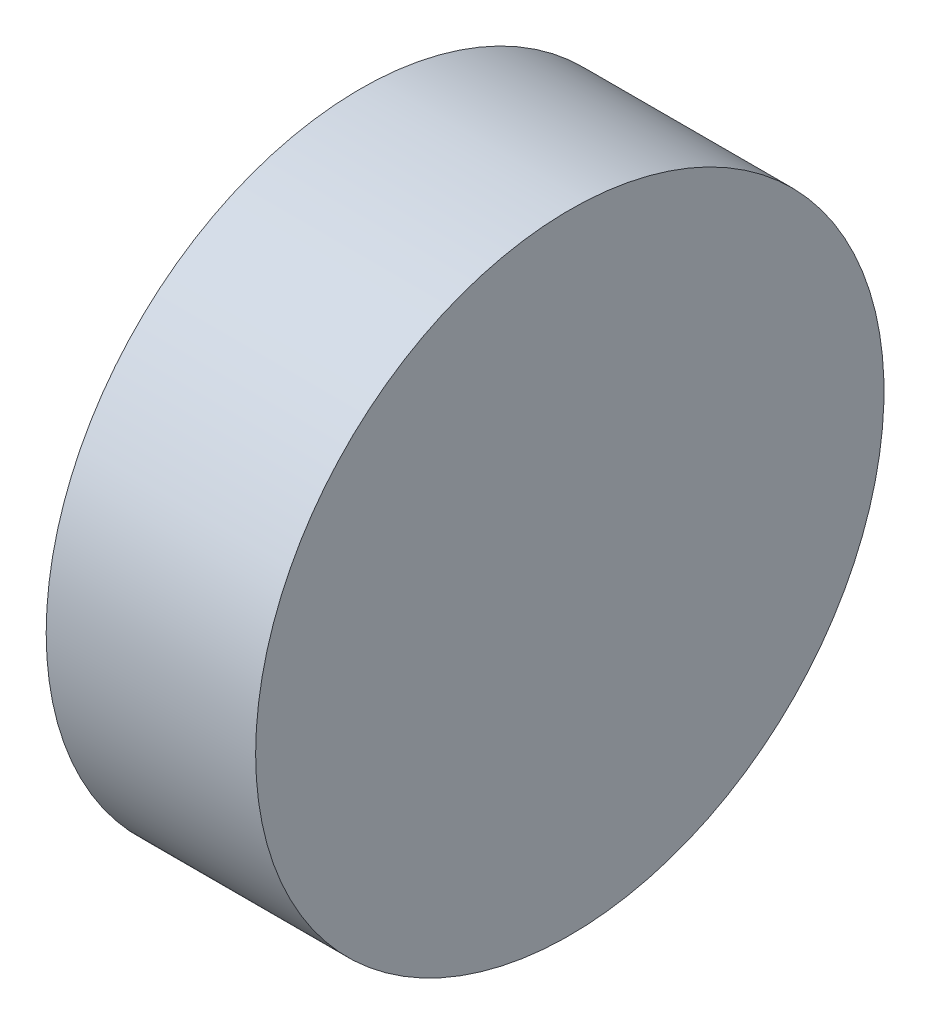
from build123d import *

# Parameters (mm, degrees)
ESQUISSE2_R      = 150
EXTRUSION1_DEPTH = 100


with BuildPart() as part:
    # Esquisse2 → Extrusion1 (new body)
    with BuildSketch(Plane(origin=(0, 0, 0), x_dir=(0, 0, -1), z_dir=(1, 0, 0))):
        with Locations(Location((0, 0, 0), (0, 0, 180))):
            Circle(ESQUISSE2_R)
    extrude(amount=EXTRUSION1_DEPTH)


solid = part.part
